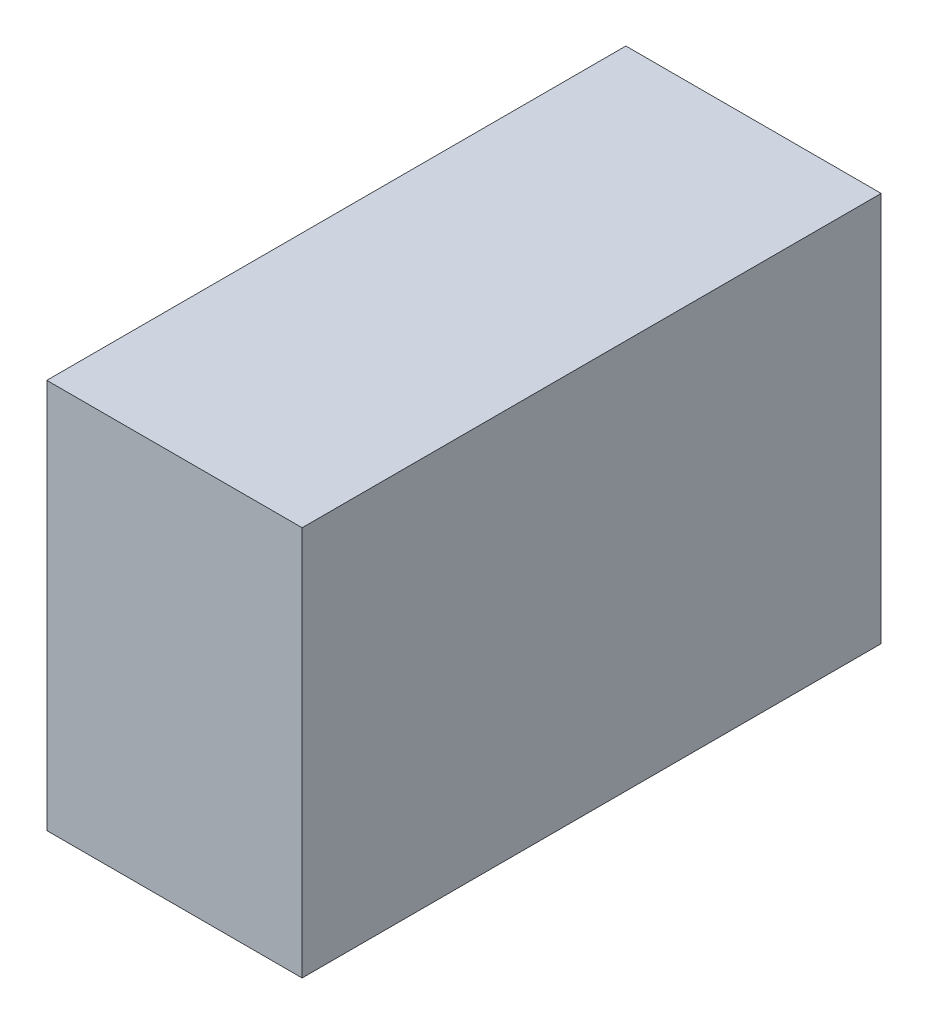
ISO-10303-21;
HEADER;
FILE_DESCRIPTION(('STEP AP214'),'2;1');
FILE_NAME('part.step','',(''),(''),'','','');
FILE_SCHEMA(('AUTOMOTIVE_DESIGN { 1 0 10303 214 1 1 1 1 }'));
ENDSEC;
DATA;
#1=APPLICATION_CONTEXT('core data for automotive mechanical design processes');
#2=APPLICATION_PROTOCOL_DEFINITION('international standard','automotive_design',2000,#1);
#3=PRODUCT_CONTEXT('',#1,'mechanical');
#4=PRODUCT('Part','Part','',(#3));
#5=PRODUCT_RELATED_PRODUCT_CATEGORY('part','',(#4));
#6=PRODUCT_DEFINITION_FORMATION('','',#4);
#7=PRODUCT_DEFINITION_CONTEXT('part definition',#1,'design');
#8=PRODUCT_DEFINITION('design','',#6,#7);
#9=PRODUCT_DEFINITION_SHAPE('','',#8);
#10=(LENGTH_UNIT() NAMED_UNIT(*) SI_UNIT(.MILLI.,.METRE.));
#11=(NAMED_UNIT(*) PLANE_ANGLE_UNIT() SI_UNIT($,.RADIAN.));
#12=(NAMED_UNIT(*) SI_UNIT($,.STERADIAN.) SOLID_ANGLE_UNIT());
#13=UNCERTAINTY_MEASURE_WITH_UNIT(LENGTH_MEASURE(1.E-05),#10,'distance_accuracy_value','');
#14=(GEOMETRIC_REPRESENTATION_CONTEXT(3) GLOBAL_UNCERTAINTY_ASSIGNED_CONTEXT((#13)) GLOBAL_UNIT_ASSIGNED_CONTEXT((#10,
#11,#12)) REPRESENTATION_CONTEXT('',''));
#15=CARTESIAN_POINT('',(0.,0.,0.));
#16=DIRECTION('',(0.,0.,1.));
#17=DIRECTION('',(1.,0.,0.));
#18=AXIS2_PLACEMENT_3D('',#15,#16,#17);
#19=CARTESIAN_POINT('',(87.1817741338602,94.2542167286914,-135.));
#20=DIRECTION('',(-1.,0.,0.));
#21=DIRECTION('',(0.,-1.,0.));
#22=AXIS2_PLACEMENT_3D('',#19,#20,#21);
#23=PLANE('',#22);
#24=DIRECTION('',(0.,0.,1.));
#25=VECTOR('',#24,1.);
#26=CARTESIAN_POINT('',(87.1817741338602,-87.5647745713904,-135.));
#27=LINE('',#26,#25);
#28=CARTESIAN_POINT('',(87.1817741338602,-87.5647745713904,-135.));
#29=VERTEX_POINT('',#28);
#30=CARTESIAN_POINT('',(87.1817741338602,-87.5647745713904,135.));
#31=VERTEX_POINT('',#30);
#32=EDGE_CURVE('E34',#29,#31,#27,.T.);
#33=ORIENTED_EDGE('',*,*,#32,.T.);
#34=DIRECTION('',(0.,-1.,0.));
#35=VECTOR('',#34,1.);
#36=CARTESIAN_POINT('',(87.1817741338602,94.2542167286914,135.));
#37=LINE('',#36,#35);
#38=CARTESIAN_POINT('',(87.1817741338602,94.2542167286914,135.));
#39=VERTEX_POINT('',#38);
#40=EDGE_CURVE('E71',#39,#31,#37,.T.);
#41=ORIENTED_EDGE('',*,*,#40,.F.);
#42=DIRECTION('',(0.,0.,1.));
#43=VECTOR('',#42,1.);
#44=CARTESIAN_POINT('',(87.1817741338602,94.2542167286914,-135.));
#45=LINE('',#44,#43);
#46=CARTESIAN_POINT('',(87.1817741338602,94.2542167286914,-135.));
#47=VERTEX_POINT('',#46);
#48=EDGE_CURVE('E11',#47,#39,#45,.T.);
#49=ORIENTED_EDGE('',*,*,#48,.F.);
#50=DIRECTION('',(0.,-1.,0.));
#51=VECTOR('',#50,1.);
#52=CARTESIAN_POINT('',(87.1817741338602,94.2542167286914,-135.));
#53=LINE('',#52,#51);
#54=EDGE_CURVE('E72',#47,#29,#53,.T.);
#55=ORIENTED_EDGE('',*,*,#54,.T.);
#56=EDGE_LOOP('',(#33,#41,#49,#55));
#57=FACE_BOUND('',#56,.T.);
#58=ADVANCED_FACE('F31',(#57),#23,.T.);
#59=CARTESIAN_POINT('',(87.1817741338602,94.2542167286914,-135.));
#60=DIRECTION('',(0.,1.,0.));
#61=DIRECTION('',(0.,0.,1.));
#62=AXIS2_PLACEMENT_3D('',#59,#60,#61);
#63=PLANE('',#62);
#64=ORIENTED_EDGE('',*,*,#48,.T.);
#65=DIRECTION('',(-1.,0.,0.));
#66=VECTOR('',#65,1.);
#67=CARTESIAN_POINT('',(87.1817741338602,94.2542167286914,135.));
#68=LINE('',#67,#66);
#69=CARTESIAN_POINT('',(206.228337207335,94.2542167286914,135.));
#70=VERTEX_POINT('',#69);
#71=EDGE_CURVE('E88',#70,#39,#68,.T.);
#72=ORIENTED_EDGE('',*,*,#71,.F.);
#73=DIRECTION('',(0.,0.,1.));
#74=VECTOR('',#73,1.);
#75=CARTESIAN_POINT('',(206.228337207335,94.2542167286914,-135.));
#76=LINE('',#75,#74);
#77=CARTESIAN_POINT('',(206.228337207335,94.2542167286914,-135.));
#78=VERTEX_POINT('',#77);
#79=EDGE_CURVE('E39',#78,#70,#76,.T.);
#80=ORIENTED_EDGE('',*,*,#79,.F.);
#81=DIRECTION('',(-1.,0.,0.));
#82=VECTOR('',#81,1.);
#83=CARTESIAN_POINT('',(87.1817741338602,94.2542167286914,-135.));
#84=LINE('',#83,#82);
#85=EDGE_CURVE('E77',#78,#47,#84,.T.);
#86=ORIENTED_EDGE('',*,*,#85,.T.);
#87=EDGE_LOOP('',(#64,#72,#80,#86));
#88=FACE_BOUND('',#87,.T.);
#89=ADVANCED_FACE('F103',(#88),#63,.T.);
#90=CARTESIAN_POINT('',(206.228337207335,94.2542167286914,-135.));
#91=DIRECTION('',(1.,0.,0.));
#92=DIRECTION('',(0.,1.,0.));
#93=AXIS2_PLACEMENT_3D('',#90,#91,#92);
#94=PLANE('',#93);
#95=ORIENTED_EDGE('',*,*,#79,.T.);
#96=DIRECTION('',(0.,1.,0.));
#97=VECTOR('',#96,1.);
#98=CARTESIAN_POINT('',(206.228337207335,94.2542167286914,135.));
#99=LINE('',#98,#97);
#100=CARTESIAN_POINT('',(206.228337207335,-87.5647745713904,135.));
#101=VERTEX_POINT('',#100);
#102=EDGE_CURVE('E84',#101,#70,#99,.T.);
#103=ORIENTED_EDGE('',*,*,#102,.F.);
#104=DIRECTION('',(0.,0.,1.));
#105=VECTOR('',#104,1.);
#106=CARTESIAN_POINT('',(206.228337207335,-87.5647745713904,-135.));
#107=LINE('',#106,#105);
#108=CARTESIAN_POINT('',(206.228337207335,-87.5647745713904,-135.));
#109=VERTEX_POINT('',#108);
#110=EDGE_CURVE('E76',#109,#101,#107,.T.);
#111=ORIENTED_EDGE('',*,*,#110,.F.);
#112=DIRECTION('',(0.,1.,0.));
#113=VECTOR('',#112,1.);
#114=CARTESIAN_POINT('',(206.228337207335,94.2542167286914,-135.));
#115=LINE('',#114,#113);
#116=EDGE_CURVE('E96',#109,#78,#115,.T.);
#117=ORIENTED_EDGE('',*,*,#116,.T.);
#118=EDGE_LOOP('',(#95,#103,#111,#117));
#119=FACE_BOUND('',#118,.T.);
#120=ADVANCED_FACE('F100',(#119),#94,.T.);
#121=CARTESIAN_POINT('',(87.1817741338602,-87.5647745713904,-135.));
#122=DIRECTION('',(0.,-1.,0.));
#123=DIRECTION('',(0.,0.,-1.));
#124=AXIS2_PLACEMENT_3D('',#121,#122,#123);
#125=PLANE('',#124);
#126=ORIENTED_EDGE('',*,*,#110,.T.);
#127=DIRECTION('',(1.,0.,0.));
#128=VECTOR('',#127,1.);
#129=CARTESIAN_POINT('',(87.1817741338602,-87.5647745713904,135.));
#130=LINE('',#129,#128);
#131=EDGE_CURVE('E79',#31,#101,#130,.T.);
#132=ORIENTED_EDGE('',*,*,#131,.F.);
#133=ORIENTED_EDGE('',*,*,#32,.F.);
#134=DIRECTION('',(1.,0.,0.));
#135=VECTOR('',#134,1.);
#136=CARTESIAN_POINT('',(87.1817741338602,-87.5647745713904,-135.));
#137=LINE('',#136,#135);
#138=EDGE_CURVE('E94',#29,#109,#137,.T.);
#139=ORIENTED_EDGE('',*,*,#138,.T.);
#140=EDGE_LOOP('',(#126,#132,#133,#139));
#141=FACE_BOUND('',#140,.T.);
#142=ADVANCED_FACE('F80',(#141),#125,.T.);
#143=CARTESIAN_POINT('',(87.1817741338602,-87.5647745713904,-135.));
#144=DIRECTION('',(0.,0.,1.));
#145=DIRECTION('',(1.,0.,0.));
#146=AXIS2_PLACEMENT_3D('',#143,#144,#145);
#147=PLANE('',#146);
#148=ORIENTED_EDGE('',*,*,#54,.F.);
#149=ORIENTED_EDGE('',*,*,#85,.F.);
#150=ORIENTED_EDGE('',*,*,#116,.F.);
#151=ORIENTED_EDGE('',*,*,#138,.F.);
#152=EDGE_LOOP('',(#148,#149,#150,#151));
#153=FACE_BOUND('',#152,.T.);
#154=ADVANCED_FACE('F105',(#153),#147,.F.);
#155=CARTESIAN_POINT('',(87.1817741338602,-87.5647745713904,135.));
#156=DIRECTION('',(0.,0.,1.));
#157=DIRECTION('',(1.,0.,0.));
#158=AXIS2_PLACEMENT_3D('',#155,#156,#157);
#159=PLANE('',#158);
#160=ORIENTED_EDGE('',*,*,#40,.T.);
#161=ORIENTED_EDGE('',*,*,#131,.T.);
#162=ORIENTED_EDGE('',*,*,#102,.T.);
#163=ORIENTED_EDGE('',*,*,#71,.T.);
#164=EDGE_LOOP('',(#160,#161,#162,#163));
#165=FACE_BOUND('',#164,.T.);
#166=ADVANCED_FACE('F87',(#165),#159,.T.);
#167=CLOSED_SHELL('',(#58,#89,#120,#142,#154,#166));
#168=MANIFOLD_SOLID_BREP('B2',#167);
#169=ADVANCED_BREP_SHAPE_REPRESENTATION('',(#18,#168),#14);
#170=SHAPE_DEFINITION_REPRESENTATION(#9,#169);
ENDSEC;
END-ISO-10303-21;
